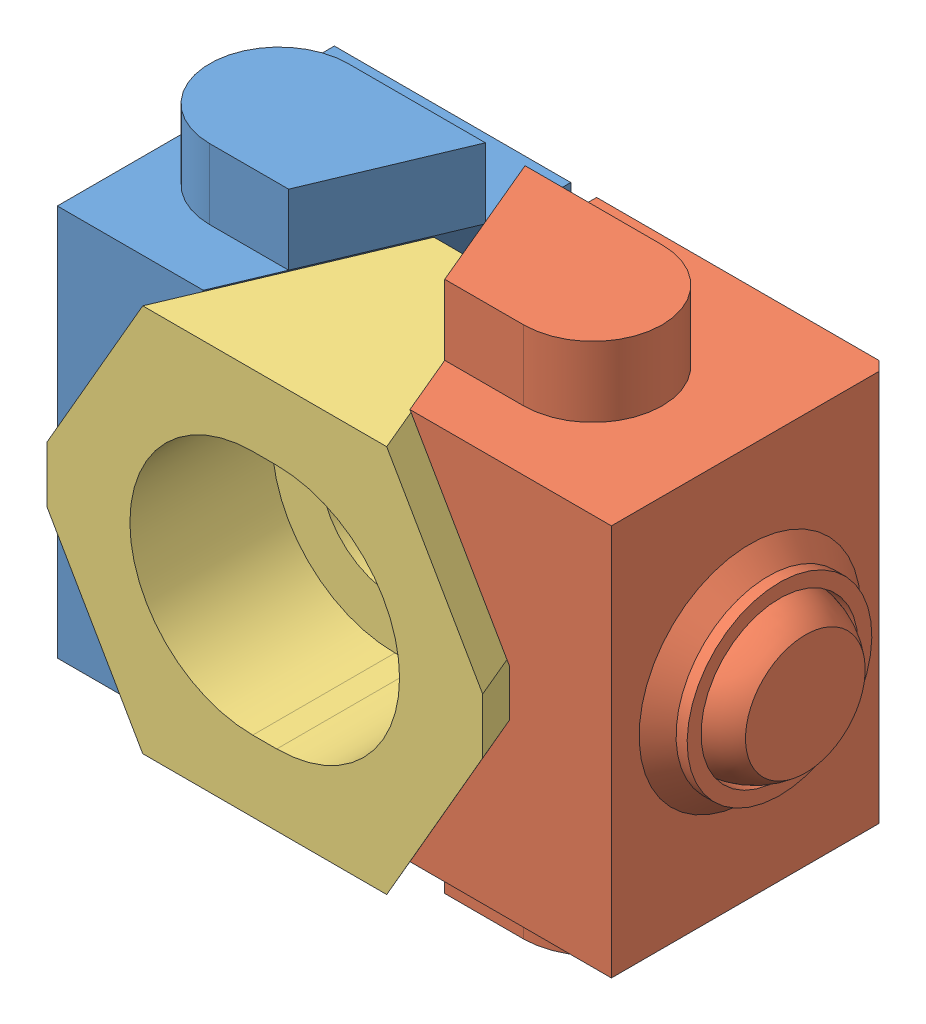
SolidWorks assembly BK2-VT-SP.SLDASM, configuration Default (file format 15000). Lengths in mm.
Overall size (33 28.8 17.27).
3 component instances, 3 part files, 0 mates.
Components (placement in the parent):
- BK2-VT-SP_01-1: BK2-VT-SP_01.SLDPRT [Default] at (-13.5 0 0) size (12.8 28.8 15)
- BK2-VT-SP_02-1: BK2-VT-SP_02.SLDPRT [Default] at (16 0 0) x (1 0 0) z (0 0 -1) size (18.8 28.8 15)
- BK2-VT-SP_03-1: BK2-VT-SP_03.SLDPRT [Default] at (0 0 6.1702) x (-1 0 0) z (0 0 1) size (23.6 21 11.1)
